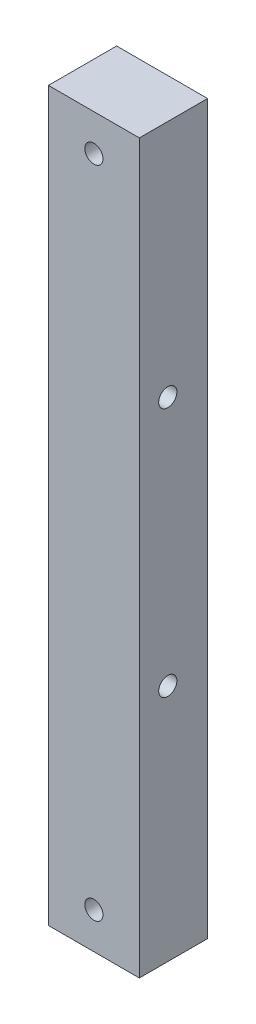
ISO-10303-21;
HEADER;
FILE_DESCRIPTION(('STEP AP214'),'2;1');
FILE_NAME('part.step','',(''),(''),'','','');
FILE_SCHEMA(('AUTOMOTIVE_DESIGN { 1 0 10303 214 1 1 1 1 }'));
ENDSEC;
DATA;
#1=APPLICATION_CONTEXT('core data for automotive mechanical design processes');
#2=APPLICATION_PROTOCOL_DEFINITION('international standard','automotive_design',2000,#1);
#3=PRODUCT_CONTEXT('',#1,'mechanical');
#4=PRODUCT('Part','Part','',(#3));
#5=PRODUCT_RELATED_PRODUCT_CATEGORY('part','',(#4));
#6=PRODUCT_DEFINITION_FORMATION('','',#4);
#7=PRODUCT_DEFINITION_CONTEXT('part definition',#1,'design');
#8=PRODUCT_DEFINITION('design','',#6,#7);
#9=PRODUCT_DEFINITION_SHAPE('','',#8);
#10=(LENGTH_UNIT() NAMED_UNIT(*) SI_UNIT(.MILLI.,.METRE.));
#11=(NAMED_UNIT(*) PLANE_ANGLE_UNIT() SI_UNIT($,.RADIAN.));
#12=(NAMED_UNIT(*) SI_UNIT($,.STERADIAN.) SOLID_ANGLE_UNIT());
#13=UNCERTAINTY_MEASURE_WITH_UNIT(LENGTH_MEASURE(1.E-05),#10,'distance_accuracy_value','');
#14=(GEOMETRIC_REPRESENTATION_CONTEXT(3) GLOBAL_UNCERTAINTY_ASSIGNED_CONTEXT((#13)) GLOBAL_UNIT_ASSIGNED_CONTEXT((#10,
#11,#12)) REPRESENTATION_CONTEXT('',''));
#15=CARTESIAN_POINT('',(0.,0.,0.));
#16=DIRECTION('',(0.,0.,1.));
#17=DIRECTION('',(1.,0.,0.));
#18=AXIS2_PLACEMENT_3D('',#15,#16,#17);
#19=CARTESIAN_POINT('',(0.,160.,0.));
#20=DIRECTION('',(1.,0.,0.));
#21=DIRECTION('',(0.,0.,-1.));
#22=AXIS2_PLACEMENT_3D('',#19,#20,#21);
#23=PLANE('',#22);
#24=CARTESIAN_POINT('',(0.,107.499999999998,-6.2499999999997));
#25=DIRECTION('',(-1.,0.,0.));
#26=DIRECTION('',(0.,0.,1.));
#27=AXIS2_PLACEMENT_3D('',#24,#25,#26);
#28=CIRCLE('',#27,2.);
#29=CARTESIAN_POINT('',(0.,107.499999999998,-4.2499999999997));
#30=VERTEX_POINT('',#29);
#31=EDGE_CURVE('E118',#30,#30,#28,.T.);
#32=ORIENTED_EDGE('',*,*,#31,.F.);
#33=EDGE_LOOP('',(#32));
#34=FACE_BOUND('',#33,.T.);
#35=CARTESIAN_POINT('',(0.,52.4999999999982,-6.24999999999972));
#36=DIRECTION('',(-1.,0.,0.));
#37=DIRECTION('',(0.,0.,1.));
#38=AXIS2_PLACEMENT_3D('',#35,#36,#37);
#39=CIRCLE('',#38,2.);
#40=CARTESIAN_POINT('',(0.,52.4999999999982,-4.24999999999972));
#41=VERTEX_POINT('',#40);
#42=EDGE_CURVE('E112',#41,#41,#39,.T.);
#43=ORIENTED_EDGE('',*,*,#42,.F.);
#44=EDGE_LOOP('',(#43));
#45=FACE_BOUND('',#44,.T.);
#46=DIRECTION('',(0.,0.,1.));
#47=VECTOR('',#46,1.);
#48=CARTESIAN_POINT('',(0.,0.,0.));
#49=LINE('',#48,#47);
#50=CARTESIAN_POINT('',(0.,0.,-15.));
#51=VERTEX_POINT('',#50);
#52=CARTESIAN_POINT('',(0.,0.,0.));
#53=VERTEX_POINT('',#52);
#54=EDGE_CURVE('E96',#51,#53,#49,.T.);
#55=ORIENTED_EDGE('',*,*,#54,.T.);
#56=DIRECTION('',(0.,-1.,0.));
#57=VECTOR('',#56,1.);
#58=CARTESIAN_POINT('',(0.,160.,0.));
#59=LINE('',#58,#57);
#60=CARTESIAN_POINT('',(0.,160.,0.));
#61=VERTEX_POINT('',#60);
#62=EDGE_CURVE('E11',#61,#53,#59,.T.);
#63=ORIENTED_EDGE('',*,*,#62,.F.);
#64=DIRECTION('',(0.,0.,1.));
#65=VECTOR('',#64,1.);
#66=CARTESIAN_POINT('',(0.,160.,0.));
#67=LINE('',#66,#65);
#68=CARTESIAN_POINT('',(0.,160.,-15.));
#69=VERTEX_POINT('',#68);
#70=EDGE_CURVE('E84',#69,#61,#67,.T.);
#71=ORIENTED_EDGE('',*,*,#70,.F.);
#72=DIRECTION('',(0.,-1.,0.));
#73=VECTOR('',#72,1.);
#74=CARTESIAN_POINT('',(0.,160.,-15.));
#75=LINE('',#74,#73);
#76=EDGE_CURVE('E92',#69,#51,#75,.T.);
#77=ORIENTED_EDGE('',*,*,#76,.T.);
#78=EDGE_LOOP('',(#55,#63,#71,#77));
#79=FACE_BOUND('',#78,.T.);
#80=ADVANCED_FACE('F33',(#34,#45,#79),#23,.F.);
#81=CARTESIAN_POINT('',(0.,160.,0.));
#82=DIRECTION('',(0.,0.,-1.));
#83=DIRECTION('',(-1.,0.,0.));
#84=AXIS2_PLACEMENT_3D('',#81,#82,#83);
#85=PLANE('',#84);
#86=CARTESIAN_POINT('',(10.,152.,0.));
#87=DIRECTION('',(0.,0.,1.));
#88=DIRECTION('',(1.,0.,0.));
#89=AXIS2_PLACEMENT_3D('',#86,#87,#88);
#90=CIRCLE('',#89,2.);
#91=CARTESIAN_POINT('',(12.,152.,0.));
#92=VERTEX_POINT('',#91);
#93=EDGE_CURVE('E130',#92,#92,#90,.T.);
#94=ORIENTED_EDGE('',*,*,#93,.F.);
#95=EDGE_LOOP('',(#94));
#96=FACE_BOUND('',#95,.T.);
#97=CARTESIAN_POINT('',(10.,8.00000000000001,0.));
#98=DIRECTION('',(0.,0.,1.));
#99=DIRECTION('',(1.,0.,0.));
#100=AXIS2_PLACEMENT_3D('',#97,#98,#99);
#101=CIRCLE('',#100,2.);
#102=CARTESIAN_POINT('',(12.,8.00000000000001,0.));
#103=VERTEX_POINT('',#102);
#104=EDGE_CURVE('E124',#103,#103,#101,.T.);
#105=ORIENTED_EDGE('',*,*,#104,.F.);
#106=EDGE_LOOP('',(#105));
#107=FACE_BOUND('',#106,.T.);
#108=DIRECTION('',(1.,0.,0.));
#109=VECTOR('',#108,1.);
#110=CARTESIAN_POINT('',(0.,0.,0.));
#111=LINE('',#110,#109);
#112=CARTESIAN_POINT('',(20.,0.,0.));
#113=VERTEX_POINT('',#112);
#114=EDGE_CURVE('E88',#53,#113,#111,.T.);
#115=ORIENTED_EDGE('',*,*,#114,.T.);
#116=DIRECTION('',(0.,-1.,0.));
#117=VECTOR('',#116,1.);
#118=CARTESIAN_POINT('',(20.,160.,0.));
#119=LINE('',#118,#117);
#120=CARTESIAN_POINT('',(20.,160.,0.));
#121=VERTEX_POINT('',#120);
#122=EDGE_CURVE('E41',#121,#113,#119,.T.);
#123=ORIENTED_EDGE('',*,*,#122,.F.);
#124=DIRECTION('',(1.,0.,0.));
#125=VECTOR('',#124,1.);
#126=CARTESIAN_POINT('',(0.,160.,0.));
#127=LINE('',#126,#125);
#128=EDGE_CURVE('E79',#61,#121,#127,.T.);
#129=ORIENTED_EDGE('',*,*,#128,.F.);
#130=ORIENTED_EDGE('',*,*,#62,.T.);
#131=EDGE_LOOP('',(#115,#123,#129,#130));
#132=FACE_BOUND('',#131,.T.);
#133=ADVANCED_FACE('F87',(#96,#107,#132),#85,.F.);
#134=CARTESIAN_POINT('',(20.,160.,0.));
#135=DIRECTION('',(-1.,0.,0.));
#136=DIRECTION('',(0.,0.,1.));
#137=AXIS2_PLACEMENT_3D('',#134,#135,#136);
#138=PLANE('',#137);
#139=CARTESIAN_POINT('',(20.,107.499999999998,-6.2499999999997));
#140=DIRECTION('',(-1.,0.,0.));
#141=DIRECTION('',(0.,0.,1.));
#142=AXIS2_PLACEMENT_3D('',#139,#140,#141);
#143=CIRCLE('',#142,2.);
#144=CARTESIAN_POINT('',(20.,107.499999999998,-4.2499999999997));
#145=VERTEX_POINT('',#144);
#146=EDGE_CURVE('E115',#145,#145,#143,.T.);
#147=ORIENTED_EDGE('',*,*,#146,.T.);
#148=EDGE_LOOP('',(#147));
#149=FACE_BOUND('',#148,.T.);
#150=CARTESIAN_POINT('',(20.,52.4999999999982,-6.24999999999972));
#151=DIRECTION('',(-1.,0.,0.));
#152=DIRECTION('',(0.,0.,1.));
#153=AXIS2_PLACEMENT_3D('',#150,#151,#152);
#154=CIRCLE('',#153,1.99999999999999);
#155=CARTESIAN_POINT('',(20.,52.4999999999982,-4.24999999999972));
#156=VERTEX_POINT('',#155);
#157=EDGE_CURVE('E99',#156,#156,#154,.T.);
#158=ORIENTED_EDGE('',*,*,#157,.T.);
#159=EDGE_LOOP('',(#158));
#160=FACE_BOUND('',#159,.T.);
#161=DIRECTION('',(0.,0.,-1.));
#162=VECTOR('',#161,1.);
#163=CARTESIAN_POINT('',(20.,0.,0.));
#164=LINE('',#163,#162);
#165=CARTESIAN_POINT('',(20.,0.,-15.));
#166=VERTEX_POINT('',#165);
#167=EDGE_CURVE('E66',#113,#166,#164,.T.);
#168=ORIENTED_EDGE('',*,*,#167,.T.);
#169=DIRECTION('',(0.,-1.,0.));
#170=VECTOR('',#169,1.);
#171=CARTESIAN_POINT('',(20.,160.,-15.));
#172=LINE('',#171,#170);
#173=CARTESIAN_POINT('',(20.,160.,-15.));
#174=VERTEX_POINT('',#173);
#175=EDGE_CURVE('E89',#174,#166,#172,.T.);
#176=ORIENTED_EDGE('',*,*,#175,.F.);
#177=DIRECTION('',(0.,0.,-1.));
#178=VECTOR('',#177,1.);
#179=CARTESIAN_POINT('',(20.,160.,0.));
#180=LINE('',#179,#178);
#181=EDGE_CURVE('E82',#121,#174,#180,.T.);
#182=ORIENTED_EDGE('',*,*,#181,.F.);
#183=ORIENTED_EDGE('',*,*,#122,.T.);
#184=EDGE_LOOP('',(#168,#176,#182,#183));
#185=FACE_BOUND('',#184,.T.);
#186=ADVANCED_FACE('F90',(#149,#160,#185),#138,.F.);
#187=CARTESIAN_POINT('',(0.,160.,-15.));
#188=DIRECTION('',(0.,0.,1.));
#189=DIRECTION('',(1.,0.,0.));
#190=AXIS2_PLACEMENT_3D('',#187,#188,#189);
#191=PLANE('',#190);
#192=CARTESIAN_POINT('',(10.,152.,-15.));
#193=DIRECTION('',(0.,0.,1.));
#194=DIRECTION('',(1.,0.,0.));
#195=AXIS2_PLACEMENT_3D('',#192,#193,#194);
#196=CIRCLE('',#195,2.);
#197=CARTESIAN_POINT('',(12.,152.,-15.));
#198=VERTEX_POINT('',#197);
#199=EDGE_CURVE('E127',#198,#198,#196,.F.);
#200=ORIENTED_EDGE('',*,*,#199,.F.);
#201=EDGE_LOOP('',(#200));
#202=FACE_BOUND('',#201,.T.);
#203=CARTESIAN_POINT('',(10.,8.00000000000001,-15.));
#204=DIRECTION('',(0.,0.,1.));
#205=DIRECTION('',(1.,0.,0.));
#206=AXIS2_PLACEMENT_3D('',#203,#204,#205);
#207=CIRCLE('',#206,2.);
#208=CARTESIAN_POINT('',(12.,8.00000000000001,-15.));
#209=VERTEX_POINT('',#208);
#210=EDGE_CURVE('E121',#209,#209,#207,.F.);
#211=ORIENTED_EDGE('',*,*,#210,.F.);
#212=EDGE_LOOP('',(#211));
#213=FACE_BOUND('',#212,.T.);
#214=DIRECTION('',(-1.,0.,0.));
#215=VECTOR('',#214,1.);
#216=CARTESIAN_POINT('',(0.,0.,-15.));
#217=LINE('',#216,#215);
#218=EDGE_CURVE('E72',#166,#51,#217,.T.);
#219=ORIENTED_EDGE('',*,*,#218,.T.);
#220=ORIENTED_EDGE('',*,*,#76,.F.);
#221=DIRECTION('',(-1.,0.,0.));
#222=VECTOR('',#221,1.);
#223=CARTESIAN_POINT('',(0.,160.,-15.));
#224=LINE('',#223,#222);
#225=EDGE_CURVE('E49',#174,#69,#224,.T.);
#226=ORIENTED_EDGE('',*,*,#225,.F.);
#227=ORIENTED_EDGE('',*,*,#175,.T.);
#228=EDGE_LOOP('',(#219,#220,#226,#227));
#229=FACE_BOUND('',#228,.T.);
#230=ADVANCED_FACE('F104',(#202,#213,#229),#191,.F.);
#231=CARTESIAN_POINT('',(0.,160.,0.));
#232=DIRECTION('',(0.,-1.,0.));
#233=DIRECTION('',(0.,0.,-1.));
#234=AXIS2_PLACEMENT_3D('',#231,#232,#233);
#235=PLANE('',#234);
#236=ORIENTED_EDGE('',*,*,#70,.T.);
#237=ORIENTED_EDGE('',*,*,#128,.T.);
#238=ORIENTED_EDGE('',*,*,#181,.T.);
#239=ORIENTED_EDGE('',*,*,#225,.T.);
#240=EDGE_LOOP('',(#236,#237,#238,#239));
#241=FACE_BOUND('',#240,.T.);
#242=ADVANCED_FACE('F80',(#241),#235,.F.);
#243=CARTESIAN_POINT('',(0.,0.,0.));
#244=DIRECTION('',(0.,-1.,0.));
#245=DIRECTION('',(0.,0.,-1.));
#246=AXIS2_PLACEMENT_3D('',#243,#244,#245);
#247=PLANE('',#246);
#248=ORIENTED_EDGE('',*,*,#54,.F.);
#249=ORIENTED_EDGE('',*,*,#218,.F.);
#250=ORIENTED_EDGE('',*,*,#167,.F.);
#251=ORIENTED_EDGE('',*,*,#114,.F.);
#252=EDGE_LOOP('',(#248,#249,#250,#251));
#253=FACE_BOUND('',#252,.T.);
#254=ADVANCED_FACE('F107',(#253),#247,.T.);
#255=CARTESIAN_POINT('',(0.,52.4999999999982,-6.24999999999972));
#256=DIRECTION('',(-1.,0.,0.));
#257=DIRECTION('',(0.,0.,1.));
#258=AXIS2_PLACEMENT_3D('',#255,#256,#257);
#259=CYLINDRICAL_SURFACE('',#258,2.);
#260=ORIENTED_EDGE('',*,*,#157,.F.);
#261=EDGE_LOOP('',(#260));
#262=FACE_BOUND('',#261,.T.);
#263=ORIENTED_EDGE('',*,*,#42,.T.);
#264=EDGE_LOOP('',(#263));
#265=FACE_BOUND('',#264,.T.);
#266=ADVANCED_FACE('F170',(#262,#265),#259,.F.);
#267=CARTESIAN_POINT('',(0.,107.499999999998,-6.2499999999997));
#268=DIRECTION('',(-1.,0.,0.));
#269=DIRECTION('',(0.,0.,1.));
#270=AXIS2_PLACEMENT_3D('',#267,#268,#269);
#271=CYLINDRICAL_SURFACE('',#270,2.);
#272=ORIENTED_EDGE('',*,*,#146,.F.);
#273=EDGE_LOOP('',(#272));
#274=FACE_BOUND('',#273,.T.);
#275=ORIENTED_EDGE('',*,*,#31,.T.);
#276=EDGE_LOOP('',(#275));
#277=FACE_BOUND('',#276,.T.);
#278=ADVANCED_FACE('F144',(#274,#277),#271,.F.);
#279=CARTESIAN_POINT('',(10.,8.00000000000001,-15.001));
#280=DIRECTION('',(0.,0.,1.));
#281=DIRECTION('',(1.,0.,0.));
#282=AXIS2_PLACEMENT_3D('',#279,#280,#281);
#283=CYLINDRICAL_SURFACE('',#282,2.);
#284=CARTESIAN_POINT('',(12.,8.00000000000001,0.));
#285=CARTESIAN_POINT('',(12.,8.00000000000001,-0.15625));
#286=CARTESIAN_POINT('',(12.,8.00000000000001,-0.3125));
#287=CARTESIAN_POINT('',(12.,8.00000000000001,-0.625000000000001));
#288=CARTESIAN_POINT('',(12.,8.00000000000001,-0.781250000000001));
#289=CARTESIAN_POINT('',(12.,8.00000000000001,-1.09375));
#290=CARTESIAN_POINT('',(12.,8.00000000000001,-1.25));
#291=CARTESIAN_POINT('',(12.,8.00000000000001,-1.5625));
#292=CARTESIAN_POINT('',(12.,8.00000000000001,-1.71875));
#293=CARTESIAN_POINT('',(12.,8.00000000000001,-2.03125));
#294=CARTESIAN_POINT('',(12.,8.00000000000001,-2.1875));
#295=CARTESIAN_POINT('',(12.,8.00000000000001,-2.5));
#296=CARTESIAN_POINT('',(12.,8.00000000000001,-2.65625));
#297=CARTESIAN_POINT('',(12.,8.00000000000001,-2.96875));
#298=CARTESIAN_POINT('',(12.,8.00000000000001,-3.125));
#299=CARTESIAN_POINT('',(12.,8.00000000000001,-3.4375));
#300=CARTESIAN_POINT('',(12.,8.00000000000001,-3.59375));
#301=CARTESIAN_POINT('',(12.,8.00000000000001,-3.90625));
#302=CARTESIAN_POINT('',(12.,8.00000000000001,-4.0625));
#303=CARTESIAN_POINT('',(12.,8.00000000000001,-4.375));
#304=CARTESIAN_POINT('',(12.,8.00000000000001,-4.53125));
#305=CARTESIAN_POINT('',(12.,8.00000000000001,-4.84375));
#306=CARTESIAN_POINT('',(12.,8.00000000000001,-5.));
#307=CARTESIAN_POINT('',(12.,8.00000000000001,-5.3125));
#308=CARTESIAN_POINT('',(12.,8.00000000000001,-5.46875));
#309=CARTESIAN_POINT('',(12.,8.00000000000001,-5.78125));
#310=CARTESIAN_POINT('',(12.,8.00000000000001,-5.9375));
#311=CARTESIAN_POINT('',(12.,8.00000000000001,-6.25));
#312=CARTESIAN_POINT('',(12.,8.00000000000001,-6.40625));
#313=CARTESIAN_POINT('',(12.,8.00000000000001,-6.71875));
#314=CARTESIAN_POINT('',(12.,8.00000000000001,-6.875));
#315=CARTESIAN_POINT('',(12.,8.00000000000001,-7.1875));
#316=CARTESIAN_POINT('',(12.,8.00000000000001,-7.34375));
#317=CARTESIAN_POINT('',(12.,8.00000000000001,-7.65625));
#318=CARTESIAN_POINT('',(12.,8.00000000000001,-7.8125));
#319=CARTESIAN_POINT('',(12.,8.00000000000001,-8.125));
#320=CARTESIAN_POINT('',(12.,8.00000000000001,-8.28125));
#321=CARTESIAN_POINT('',(12.,8.00000000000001,-8.59375));
#322=CARTESIAN_POINT('',(12.,8.00000000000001,-8.75));
#323=CARTESIAN_POINT('',(12.,8.00000000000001,-9.0625));
#324=CARTESIAN_POINT('',(12.,8.00000000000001,-9.21875));
#325=CARTESIAN_POINT('',(12.,8.00000000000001,-9.53125));
#326=CARTESIAN_POINT('',(12.,8.00000000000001,-9.6875));
#327=CARTESIAN_POINT('',(12.,8.00000000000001,-10.));
#328=CARTESIAN_POINT('',(12.,8.00000000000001,-10.15625));
#329=CARTESIAN_POINT('',(12.,8.00000000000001,-10.46875));
#330=CARTESIAN_POINT('',(12.,8.00000000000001,-10.625));
#331=CARTESIAN_POINT('',(12.,8.00000000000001,-10.9375));
#332=CARTESIAN_POINT('',(12.,8.00000000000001,-11.09375));
#333=CARTESIAN_POINT('',(12.,8.00000000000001,-11.40625));
#334=CARTESIAN_POINT('',(12.,8.00000000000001,-11.5625));
#335=CARTESIAN_POINT('',(12.,8.00000000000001,-11.875));
#336=CARTESIAN_POINT('',(12.,8.00000000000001,-12.03125));
#337=CARTESIAN_POINT('',(12.,8.00000000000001,-12.34375));
#338=CARTESIAN_POINT('',(12.,8.00000000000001,-12.5));
#339=CARTESIAN_POINT('',(12.,8.00000000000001,-12.8125));
#340=CARTESIAN_POINT('',(12.,8.00000000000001,-12.96875));
#341=CARTESIAN_POINT('',(12.,8.00000000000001,-13.28125));
#342=CARTESIAN_POINT('',(12.,8.00000000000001,-13.4375));
#343=CARTESIAN_POINT('',(12.,8.00000000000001,-13.75));
#344=CARTESIAN_POINT('',(12.,8.00000000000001,-13.90625));
#345=CARTESIAN_POINT('',(12.,8.00000000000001,-14.21875));
#346=CARTESIAN_POINT('',(12.,8.00000000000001,-14.375));
#347=CARTESIAN_POINT('',(12.,8.00000000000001,-14.6875));
#348=CARTESIAN_POINT('',(12.,8.00000000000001,-14.84375));
#349=CARTESIAN_POINT('',(12.,8.00000000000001,-15.));
#350=B_SPLINE_CURVE_WITH_KNOTS('',3,(#284,#285,#286,#287,#288,#289,#290,#291,#292,#293,#294,
#295,#296,#297,#298,#299,#300,#301,#302,#303,#304,#305,#306,#307,#308,#309,#310,#311,#312,#313,
#314,#315,#316,#317,#318,#319,#320,#321,#322,#323,#324,#325,#326,#327,#328,#329,#330,#331,#332,
#333,#334,#335,#336,#337,#338,#339,#340,#341,#342,#343,#344,#345,#346,#347,#348,#349),
.UNSPECIFIED.,.F.,.F.,(4,2,2,2,2,2,2,2,2,2,2,2,2,2,2,2,2,2,2,2,2,2,2,2,2,2,2,2,2,2,2,2,4),(0.,
0.46875,0.937500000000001,1.40625,1.875,2.34375,2.8125,3.28125,3.75,4.21875,4.6875,5.15625,
5.625,6.09375,6.5625,7.03125,7.5,7.96875,8.4375,8.90625,9.375,9.84375,10.3125,10.78125,11.25,
11.71875,12.1875,12.65625,13.125,13.59375,14.0625,14.53125,15.),.UNSPECIFIED.);
#351=EDGE_CURVE('BSEAM141',#103,#209,#350,.T.);
#352=ORIENTED_EDGE('',*,*,#104,.T.);
#353=ORIENTED_EDGE('',*,*,#210,.T.);
#354=ORIENTED_EDGE('',*,*,#351,.T.);
#355=ORIENTED_EDGE('',*,*,#351,.F.);
#356=EDGE_LOOP('',(#352,#354,#353,#355));
#357=FACE_BOUND('',#356,.T.);
#358=ADVANCED_FACE('F141',(#357),#283,.F.);
#359=CARTESIAN_POINT('',(10.,152.,-15.001));
#360=DIRECTION('',(0.,0.,1.));
#361=DIRECTION('',(1.,0.,0.));
#362=AXIS2_PLACEMENT_3D('',#359,#360,#361);
#363=CYLINDRICAL_SURFACE('',#362,2.);
#364=CARTESIAN_POINT('',(12.,152.,0.));
#365=CARTESIAN_POINT('',(12.,152.,-0.15625));
#366=CARTESIAN_POINT('',(12.,152.,-0.3125));
#367=CARTESIAN_POINT('',(12.,152.,-0.625000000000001));
#368=CARTESIAN_POINT('',(12.,152.,-0.781250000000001));
#369=CARTESIAN_POINT('',(12.,152.,-1.09375));
#370=CARTESIAN_POINT('',(12.,152.,-1.25));
#371=CARTESIAN_POINT('',(12.,152.,-1.5625));
#372=CARTESIAN_POINT('',(12.,152.,-1.71875));
#373=CARTESIAN_POINT('',(12.,152.,-2.03125));
#374=CARTESIAN_POINT('',(12.,152.,-2.1875));
#375=CARTESIAN_POINT('',(12.,152.,-2.5));
#376=CARTESIAN_POINT('',(12.,152.,-2.65625));
#377=CARTESIAN_POINT('',(12.,152.,-2.96875));
#378=CARTESIAN_POINT('',(12.,152.,-3.125));
#379=CARTESIAN_POINT('',(12.,152.,-3.4375));
#380=CARTESIAN_POINT('',(12.,152.,-3.59375));
#381=CARTESIAN_POINT('',(12.,152.,-3.90625));
#382=CARTESIAN_POINT('',(12.,152.,-4.0625));
#383=CARTESIAN_POINT('',(12.,152.,-4.375));
#384=CARTESIAN_POINT('',(12.,152.,-4.53125));
#385=CARTESIAN_POINT('',(12.,152.,-4.84375));
#386=CARTESIAN_POINT('',(12.,152.,-5.));
#387=CARTESIAN_POINT('',(12.,152.,-5.3125));
#388=CARTESIAN_POINT('',(12.,152.,-5.46875));
#389=CARTESIAN_POINT('',(12.,152.,-5.78125));
#390=CARTESIAN_POINT('',(12.,152.,-5.9375));
#391=CARTESIAN_POINT('',(12.,152.,-6.25));
#392=CARTESIAN_POINT('',(12.,152.,-6.40625));
#393=CARTESIAN_POINT('',(12.,152.,-6.71875));
#394=CARTESIAN_POINT('',(12.,152.,-6.875));
#395=CARTESIAN_POINT('',(12.,152.,-7.1875));
#396=CARTESIAN_POINT('',(12.,152.,-7.34375));
#397=CARTESIAN_POINT('',(12.,152.,-7.65625));
#398=CARTESIAN_POINT('',(12.,152.,-7.8125));
#399=CARTESIAN_POINT('',(12.,152.,-8.125));
#400=CARTESIAN_POINT('',(12.,152.,-8.28125));
#401=CARTESIAN_POINT('',(12.,152.,-8.59375));
#402=CARTESIAN_POINT('',(12.,152.,-8.75));
#403=CARTESIAN_POINT('',(12.,152.,-9.0625));
#404=CARTESIAN_POINT('',(12.,152.,-9.21875));
#405=CARTESIAN_POINT('',(12.,152.,-9.53125));
#406=CARTESIAN_POINT('',(12.,152.,-9.6875));
#407=CARTESIAN_POINT('',(12.,152.,-10.));
#408=CARTESIAN_POINT('',(12.,152.,-10.15625));
#409=CARTESIAN_POINT('',(12.,152.,-10.46875));
#410=CARTESIAN_POINT('',(12.,152.,-10.625));
#411=CARTESIAN_POINT('',(12.,152.,-10.9375));
#412=CARTESIAN_POINT('',(12.,152.,-11.09375));
#413=CARTESIAN_POINT('',(12.,152.,-11.40625));
#414=CARTESIAN_POINT('',(12.,152.,-11.5625));
#415=CARTESIAN_POINT('',(12.,152.,-11.875));
#416=CARTESIAN_POINT('',(12.,152.,-12.03125));
#417=CARTESIAN_POINT('',(12.,152.,-12.34375));
#418=CARTESIAN_POINT('',(12.,152.,-12.5));
#419=CARTESIAN_POINT('',(12.,152.,-12.8125));
#420=CARTESIAN_POINT('',(12.,152.,-12.96875));
#421=CARTESIAN_POINT('',(12.,152.,-13.28125));
#422=CARTESIAN_POINT('',(12.,152.,-13.4375));
#423=CARTESIAN_POINT('',(12.,152.,-13.75));
#424=CARTESIAN_POINT('',(12.,152.,-13.90625));
#425=CARTESIAN_POINT('',(12.,152.,-14.21875));
#426=CARTESIAN_POINT('',(12.,152.,-14.375));
#427=CARTESIAN_POINT('',(12.,152.,-14.6875));
#428=CARTESIAN_POINT('',(12.,152.,-14.84375));
#429=CARTESIAN_POINT('',(12.,152.,-15.));
#430=B_SPLINE_CURVE_WITH_KNOTS('',3,(#364,#365,#366,#367,#368,#369,#370,#371,#372,#373,#374,
#375,#376,#377,#378,#379,#380,#381,#382,#383,#384,#385,#386,#387,#388,#389,#390,#391,#392,#393,
#394,#395,#396,#397,#398,#399,#400,#401,#402,#403,#404,#405,#406,#407,#408,#409,#410,#411,#412,
#413,#414,#415,#416,#417,#418,#419,#420,#421,#422,#423,#424,#425,#426,#427,#428,#429),
.UNSPECIFIED.,.F.,.F.,(4,2,2,2,2,2,2,2,2,2,2,2,2,2,2,2,2,2,2,2,2,2,2,2,2,2,2,2,2,2,2,2,4),(0.,
0.46875,0.937500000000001,1.40625,1.875,2.34375,2.8125,3.28125,3.75,4.21875,4.6875,5.15625,
5.625,6.09375,6.5625,7.03125,7.5,7.96875,8.4375,8.90625,9.375,9.84375,10.3125,10.78125,11.25,
11.71875,12.1875,12.65625,13.125,13.59375,14.0625,14.53125,15.),.UNSPECIFIED.);
#431=EDGE_CURVE('BSEAM134',#92,#198,#430,.T.);
#432=ORIENTED_EDGE('',*,*,#93,.T.);
#433=ORIENTED_EDGE('',*,*,#199,.T.);
#434=ORIENTED_EDGE('',*,*,#431,.T.);
#435=ORIENTED_EDGE('',*,*,#431,.F.);
#436=EDGE_LOOP('',(#432,#434,#433,#435));
#437=FACE_BOUND('',#436,.T.);
#438=ADVANCED_FACE('F134',(#437),#363,.F.);
#439=CLOSED_SHELL('',(#80,#133,#186,#230,#242,#254,#266,#278,#358,#438));
#440=MANIFOLD_SOLID_BREP('B2',#439);
#441=ADVANCED_BREP_SHAPE_REPRESENTATION('',(#18,#440),#14);
#442=SHAPE_DEFINITION_REPRESENTATION(#9,#441);
ENDSEC;
END-ISO-10303-21;
